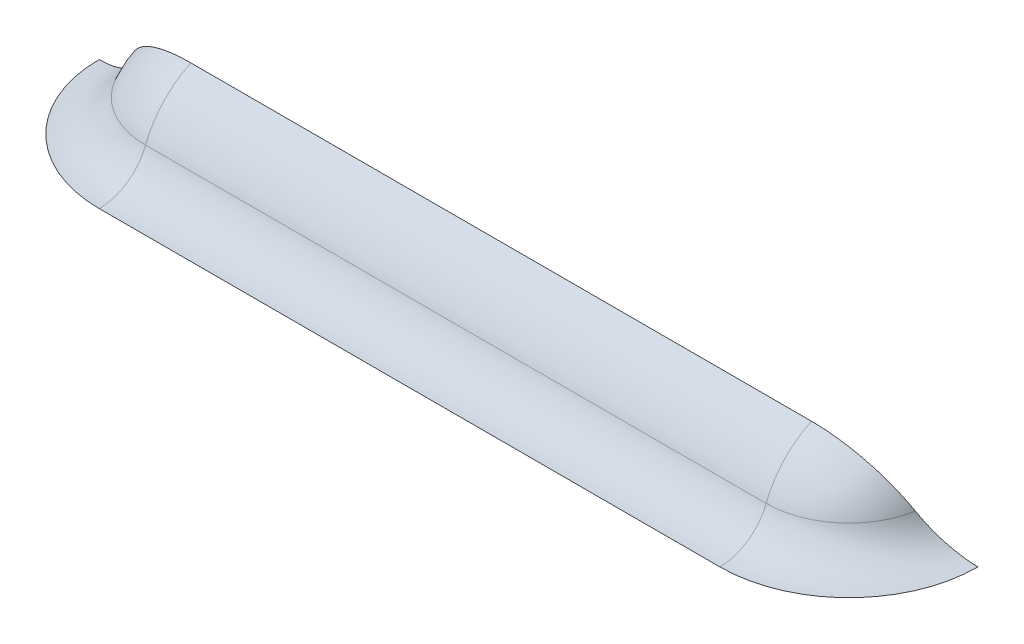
from build123d import *

# Parameters (mm, degrees)
SKETCH1_W               = 50.8
SKETCH1_H               = 3.464243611
BASE_EXTRUDE_DEPTH      = 50.8
BOSS_EXTRUDE1_DEPTH     = 19.05
BOSS_REVOLVE1_ANGLE     = 90
FILLET1_R               = 3.048
CUT_EXTRUDE2_DEPTH      = 58.490562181
CUT_EXTRUDE2_DEPTH_BACK = 58.490562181
SKETCH5_W               = 50.8
SKETCH5_H               = 3.464243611
CUT_EXTRUDE1_DEPTH      = 106.06310615


with BuildPart() as part:
    # Sketch1 → Base-Extrude (new, symmetric)
    with BuildSketch(Plane(origin=(0, 0, 0), x_dir=(0, 0, -1), z_dir=(1, 0, 0))):
        with Locations((0, 1.732121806)):
            Rectangle(SKETCH1_W, SKETCH1_H)
    extrude(amount=BASE_EXTRUDE_DEPTH, both=True)

    # Sketch3 → Boss-Extrude1 (add, symmetric)
    with BuildSketch(Plane(origin=(0, 4.664955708, 2.581196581), x_dir=(0, 0, 1), z_dir=(1, 0, 0))):
        with BuildLine():
            Line((-4.547008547, 1.200712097), (-4.547008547, -4.243732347))
            ThreePointArc((-4.547008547, -4.243732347), (-0.697204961, -2.649091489), (0.897435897, 1.200712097))
            Line((0.897435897, 1.200712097), (-4.547008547, 1.200712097))
        make_face()
    extrude(amount=BOSS_EXTRUDE1_DEPTH, both=True)

    # Sketch4 → Boss-Revolve1 (revolve)
    with BuildSketch(Plane.ZY.offset(19.05)):
        with BuildLine():
            Line((-1.965811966, 3.464243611), (3.478632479, 3.464243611))
            ThreePointArc((3.478632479, 3.464243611), (1.883991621, 7.314047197), (-1.965811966, 8.908688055))
            Line((-1.965811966, 8.908688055), (-1.965811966, 3.464243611))
        make_face()
    boss_revolve1 = revolve(axis=Axis((-19.05, 3.464243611, -1.965811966), (0, -1, 0)), revolution_arc=BOSS_REVOLVE1_ANGLE)

    # Mirror1: Boss-Revolve1 across plane
    add(boss_revolve1.mirror(Plane(origin=(0, 0, 0), x_dir=(0, 0, 1), z_dir=(1, 0, 0))))

    # Fillet1
    fillet1_edges = [part.edges().sort_by_distance(p)[0] for p in [
        (0, 3.464243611, 3.478632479),
        (-22.899803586, 3.464243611, 1.883991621),
        (22.899803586, 3.464243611, 1.883991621),
    ]]
    fillet(fillet1_edges, radius=FILLET1_R)

    # Sketch7 → Cut-Extrude2 (cut, two sides: drawn at the far end of the back side and taken through both)
    with BuildSketch(Plane(origin=(0, 0, 0), x_dir=(0, 0, -1), z_dir=(1, 0, 0)).offset(-CUT_EXTRUDE2_DEPTH_BACK)):
        with BuildLine():
            Line((1.965811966, 3.464243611), (-0.335109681, 8.398586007))
            ThreePointArc((-0.335109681, 8.398586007), (0.787418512, 8.779632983), (1.965811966, 8.908688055))
            Line((1.965811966, 8.908688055), (1.965811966, 3.464243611))
        make_face()
    extrude(amount=CUT_EXTRUDE2_DEPTH + CUT_EXTRUDE2_DEPTH_BACK, mode=Mode.SUBTRACT)

    # Sketch5 → Cut-Extrude1 (cut, through all)
    with BuildSketch(Plane.ZY.offset(50.8)):
        with Locations((0, 1.732121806)):
            Rectangle(SKETCH5_W, SKETCH5_H)
    extrude(amount=-CUT_EXTRUDE1_DEPTH, mode=Mode.SUBTRACT)


solid = part.part
